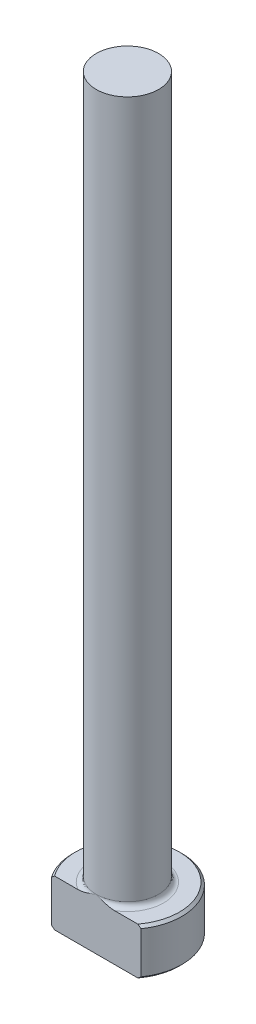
ISO-10303-21;
HEADER;
FILE_DESCRIPTION(('STEP AP214'),'2;1');
FILE_NAME('part.step','',(''),(''),'','','');
FILE_SCHEMA(('AUTOMOTIVE_DESIGN { 1 0 10303 214 1 1 1 1 }'));
ENDSEC;
DATA;
#1=APPLICATION_CONTEXT('core data for automotive mechanical design processes');
#2=APPLICATION_PROTOCOL_DEFINITION('international standard','automotive_design',2000,#1);
#3=PRODUCT_CONTEXT('',#1,'mechanical');
#4=PRODUCT('Part','Part','',(#3));
#5=PRODUCT_RELATED_PRODUCT_CATEGORY('part','',(#4));
#6=PRODUCT_DEFINITION_FORMATION('','',#4);
#7=PRODUCT_DEFINITION_CONTEXT('part definition',#1,'design');
#8=PRODUCT_DEFINITION('design','',#6,#7);
#9=PRODUCT_DEFINITION_SHAPE('','',#8);
#10=(LENGTH_UNIT() NAMED_UNIT(*) SI_UNIT(.MILLI.,.METRE.));
#11=(NAMED_UNIT(*) PLANE_ANGLE_UNIT() SI_UNIT($,.RADIAN.));
#12=(NAMED_UNIT(*) SI_UNIT($,.STERADIAN.) SOLID_ANGLE_UNIT());
#13=UNCERTAINTY_MEASURE_WITH_UNIT(LENGTH_MEASURE(1.E-05),#10,'distance_accuracy_value','');
#14=(GEOMETRIC_REPRESENTATION_CONTEXT(3) GLOBAL_UNCERTAINTY_ASSIGNED_CONTEXT((#13)) GLOBAL_UNIT_ASSIGNED_CONTEXT((#10,
#11,#12)) REPRESENTATION_CONTEXT('',''));
#15=CARTESIAN_POINT('',(0.,0.,0.));
#16=DIRECTION('',(0.,0.,1.));
#17=DIRECTION('',(1.,0.,0.));
#18=AXIS2_PLACEMENT_3D('',#15,#16,#17);
#19=CARTESIAN_POINT('',(0.,0.,0.));
#20=DIRECTION('',(0.,-1.,0.));
#21=DIRECTION('',(0.,0.,-1.));
#22=AXIS2_PLACEMENT_3D('',#19,#20,#21);
#23=PLANE('',#22);
#24=CARTESIAN_POINT('',(0.,0.,0.));
#25=DIRECTION('',(0.,-1.,0.));
#26=DIRECTION('',(0.,0.,-1.));
#27=AXIS2_PLACEMENT_3D('',#24,#25,#26);
#28=CIRCLE('',#27,5.29589999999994);
#29=CARTESIAN_POINT('',(-4.2386238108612,0.,3.17499999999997));
#30=VERTEX_POINT('',#29);
#31=CARTESIAN_POINT('',(4.2386238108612,0.,3.17499999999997));
#32=VERTEX_POINT('',#31);
#33=EDGE_CURVE('E98',#30,#32,#28,.T.);
#34=ORIENTED_EDGE('',*,*,#33,.T.);
#35=DIRECTION('',(-1.,0.,0.));
#36=VECTOR('',#35,1.);
#37=CARTESIAN_POINT('',(-4.55200670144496,0.,3.17499999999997));
#38=LINE('',#37,#36);
#39=EDGE_CURVE('E83',#32,#30,#38,.T.);
#40=ORIENTED_EDGE('',*,*,#39,.T.);
#41=EDGE_LOOP('',(#34,#40));
#42=FACE_BOUND('',#41,.T.);
#43=ADVANCED_FACE('F32',(#42),#23,.T.);
#44=CARTESIAN_POINT('',(0.,259.958771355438,0.));
#45=DIRECTION('',(0.,1.,0.));
#46=DIRECTION('',(0.,0.,1.));
#47=AXIS2_PLACEMENT_3D('',#44,#45,#46);
#48=CYLINDRICAL_SURFACE('',#47,5.54989999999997);
#49=CARTESIAN_POINT('',(0.,4.49580000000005,0.));
#50=DIRECTION('',(0.,1.,0.));
#51=DIRECTION('',(0.,0.,1.));
#52=AXIS2_PLACEMENT_3D('',#49,#50,#51);
#53=CIRCLE('',#52,5.54989999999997);
#54=CARTESIAN_POINT('',(-4.55200670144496,4.49580000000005,3.17499999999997));
#55=VERTEX_POINT('',#54);
#56=CARTESIAN_POINT('',(4.55200670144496,4.49580000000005,3.17499999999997));
#57=VERTEX_POINT('',#56);
#58=EDGE_CURVE('E104',#55,#57,#53,.F.);
#59=ORIENTED_EDGE('',*,*,#58,.T.);
#60=DIRECTION('',(0.,-1.,0.));
#61=VECTOR('',#60,1.);
#62=CARTESIAN_POINT('',(4.55200670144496,76.2,3.17499999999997));
#63=LINE('',#62,#61);
#64=CARTESIAN_POINT('',(4.55200670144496,0.254000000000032,3.17499999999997));
#65=VERTEX_POINT('',#64);
#66=EDGE_CURVE('E183',#57,#65,#63,.T.);
#67=ORIENTED_EDGE('',*,*,#66,.T.);
#68=CARTESIAN_POINT('',(0.,0.254000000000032,0.));
#69=DIRECTION('',(0.,-1.,0.));
#70=DIRECTION('',(0.,0.,-1.));
#71=AXIS2_PLACEMENT_3D('',#68,#69,#70);
#72=CIRCLE('',#71,5.54989999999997);
#73=CARTESIAN_POINT('',(-4.55200670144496,0.254000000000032,3.17499999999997));
#74=VERTEX_POINT('',#73);
#75=EDGE_CURVE('E100',#65,#74,#72,.F.);
#76=ORIENTED_EDGE('',*,*,#75,.T.);
#77=DIRECTION('',(0.,-1.,0.));
#78=VECTOR('',#77,1.);
#79=CARTESIAN_POINT('',(-4.55200670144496,76.2,3.17499999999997));
#80=LINE('',#79,#78);
#81=EDGE_CURVE('E93',#55,#74,#80,.T.);
#82=ORIENTED_EDGE('',*,*,#81,.F.);
#83=EDGE_LOOP('',(#59,#67,#76,#82));
#84=FACE_BOUND('',#83,.T.);
#85=ADVANCED_FACE('F158',(#84),#48,.T.);
#86=CARTESIAN_POINT('',(-5.54989999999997,4.7498,0.));
#87=DIRECTION('',(0.,1.,0.));
#88=DIRECTION('',(0.,0.,1.));
#89=AXIS2_PLACEMENT_3D('',#86,#87,#88);
#90=PLANE('',#89);
#91=CARTESIAN_POINT('',(0.,4.7498,0.));
#92=DIRECTION('',(0.,1.,0.));
#93=DIRECTION('',(0.,0.,1.));
#94=AXIS2_PLACEMENT_3D('',#91,#92,#93);
#95=CIRCLE('',#94,5.29590000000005);
#96=CARTESIAN_POINT('',(4.23862381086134,4.7498,3.17499999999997));
#97=VERTEX_POINT('',#96);
#98=CARTESIAN_POINT('',(-4.23862381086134,4.7498,3.17499999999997));
#99=VERTEX_POINT('',#98);
#100=EDGE_CURVE('E178',#97,#99,#95,.T.);
#101=ORIENTED_EDGE('',*,*,#100,.T.);
#102=DIRECTION('',(1.,0.,0.));
#103=VECTOR('',#102,1.);
#104=CARTESIAN_POINT('',(-5.54989999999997,4.7498,3.17499999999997));
#105=LINE('',#104,#103);
#106=CARTESIAN_POINT('',(-1.86651118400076,4.74979999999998,3.17499999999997));
#107=VERTEX_POINT('',#106);
#108=EDGE_CURVE('E57',#99,#107,#105,.T.);
#109=ORIENTED_EDGE('',*,*,#108,.T.);
#110=CARTESIAN_POINT('',(0.,4.7498,0.));
#111=DIRECTION('',(0.,1.,0.));
#112=DIRECTION('',(0.,0.,1.));
#113=AXIS2_PLACEMENT_3D('',#110,#111,#112);
#114=CIRCLE('',#113,3.68299999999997);
#115=CARTESIAN_POINT('',(1.86651118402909,4.74979999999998,3.17499999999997));
#116=VERTEX_POINT('',#115);
#117=EDGE_CURVE('E107',#107,#116,#114,.F.);
#118=ORIENTED_EDGE('',*,*,#117,.T.);
#119=EDGE_CURVE('E136',#116,#97,#105,.T.);
#120=ORIENTED_EDGE('',*,*,#119,.T.);
#121=EDGE_LOOP('',(#101,#109,#118,#120));
#122=FACE_BOUND('',#121,.T.);
#123=ADVANCED_FACE('F147',(#122),#90,.T.);
#124=CARTESIAN_POINT('',(0.,4.74980000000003,0.));
#125=DIRECTION('',(0.,-1.,0.));
#126=DIRECTION('',(0.,0.,-1.));
#127=AXIS2_PLACEMENT_3D('',#124,#125,#126);
#128=CONICAL_SURFACE('',#127,5.29590000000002,0.785398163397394);
#129=ORIENTED_EDGE('',*,*,#58,.F.);
#130=CARTESIAN_POINT('',(-10.0167402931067,-0.462188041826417,3.17499999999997));
#131=CARTESIAN_POINT('',(-9.83956615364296,-0.29329908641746,3.17499999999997));
#132=CARTESIAN_POINT('',(-9.66219175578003,-0.124620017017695,3.17499999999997));
#133=CARTESIAN_POINT('',(-9.3069644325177,0.212235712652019,3.17499999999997));
#134=CARTESIAN_POINT('',(-9.12911150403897,0.380412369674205,3.17499999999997));
#135=CARTESIAN_POINT('',(-8.59460771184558,0.88416858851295,3.17499999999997));
#136=CARTESIAN_POINT('',(-8.23712475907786,1.21886656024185,3.17499999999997));
#137=CARTESIAN_POINT('',(-7.51548848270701,1.88820774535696,3.17499999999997));
#138=CARTESIAN_POINT('',(-7.15130415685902,2.22281765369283,3.17499999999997));
#139=CARTESIAN_POINT('',(-6.60150494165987,2.72077471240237,3.17499999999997));
#140=CARTESIAN_POINT('',(-6.41766956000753,2.88608479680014,3.17499999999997));
#141=CARTESIAN_POINT('',(-6.04850874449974,3.21502923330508,3.17499999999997));
#142=CARTESIAN_POINT('',(-5.86318332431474,3.37866360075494,3.17499999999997));
#143=CARTESIAN_POINT('',(-5.42475636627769,3.76132794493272,3.17499999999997));
#144=CARTESIAN_POINT('',(-5.17087613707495,3.97947167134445,3.17499999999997));
#145=CARTESIAN_POINT('',(-4.78637219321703,4.30242579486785,3.17499999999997));
#146=CARTESIAN_POINT('',(-4.65755933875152,4.40939174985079,3.17499999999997));
#147=CARTESIAN_POINT('',(-4.39846835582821,4.6215318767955,3.17499999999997));
#148=CARTESIAN_POINT('',(-4.26819026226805,4.72670609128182,3.17499999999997));
#149=CARTESIAN_POINT('',(-4.00614386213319,4.93458819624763,3.17499999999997));
#150=CARTESIAN_POINT('',(-3.87437946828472,5.0373010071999,3.17499999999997));
#151=CARTESIAN_POINT('',(-3.60868880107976,5.23988426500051,3.17499999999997));
#152=CARTESIAN_POINT('',(-3.47476266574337,5.33975489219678,3.17499999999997));
#153=CARTESIAN_POINT('',(-3.20432566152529,5.53575009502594,3.17499999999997));
#154=CARTESIAN_POINT('',(-3.06781662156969,5.63187718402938,3.17499999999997));
#155=CARTESIAN_POINT('',(-2.79150743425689,5.81925786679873,3.17499999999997));
#156=CARTESIAN_POINT('',(-2.65170798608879,5.91051248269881,3.17499999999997));
#157=CARTESIAN_POINT('',(-2.40080357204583,6.06610461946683,3.17499999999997));
#158=CARTESIAN_POINT('',(-2.29053645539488,6.13178781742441,3.17499999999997));
#159=CARTESIAN_POINT('',(-2.06714717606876,6.25818980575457,3.17499999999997));
#160=CARTESIAN_POINT('',(-1.95402458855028,6.31890785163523,3.17499999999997));
#161=CARTESIAN_POINT('',(-1.72463633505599,6.43389240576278,3.17499999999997));
#162=CARTESIAN_POINT('',(-1.60837338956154,6.48816429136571,3.17499999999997));
#163=CARTESIAN_POINT('',(-1.37232485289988,6.58846115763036,3.17499999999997));
#164=CARTESIAN_POINT('',(-1.25254039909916,6.63448876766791,3.17499999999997));
#165=CARTESIAN_POINT('',(-1.03847127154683,6.70631999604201,3.17499999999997));
#166=CARTESIAN_POINT('',(-0.944930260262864,6.73432823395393,3.17499999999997));
#167=CARTESIAN_POINT('',(-0.75601186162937,6.78320653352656,3.17499999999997));
#168=CARTESIAN_POINT('',(-0.660635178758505,6.80407927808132,3.17499999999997));
#169=CARTESIAN_POINT('',(-0.46875225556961,6.83766834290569,3.17499999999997));
#170=CARTESIAN_POINT('',(-0.372250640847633,6.85041070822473,3.17499999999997));
#171=CARTESIAN_POINT('',(-0.178484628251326,6.86715141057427,3.17499999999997));
#172=CARTESIAN_POINT('',(-0.0812202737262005,6.87115024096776,3.17499999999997));
#173=CARTESIAN_POINT('',(0.113557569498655,6.87016742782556,3.17499999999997));
#174=CARTESIAN_POINT('',(0.211070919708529,6.86515852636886,3.17499999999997));
#175=CARTESIAN_POINT('',(0.405245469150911,6.84640245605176,3.17499999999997));
#176=CARTESIAN_POINT('',(0.501906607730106,6.83265467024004,3.17499999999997));
#177=CARTESIAN_POINT('',(0.694033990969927,6.79710670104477,3.17499999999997));
#178=CARTESIAN_POINT('',(0.789495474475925,6.77528112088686,3.17499999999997));
#179=CARTESIAN_POINT('',(0.978501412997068,6.72458544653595,3.17499999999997));
#180=CARTESIAN_POINT('',(1.07204574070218,6.69571488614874,3.17499999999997));
#181=CARTESIAN_POINT('',(1.36820011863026,6.59374975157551,3.17499999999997));
#182=CARTESIAN_POINT('',(1.56688529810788,6.50918166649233,3.17499999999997));
#183=CARTESIAN_POINT('',(1.85781194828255,6.36807703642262,3.17499999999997));
#184=CARTESIAN_POINT('',(1.95370879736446,6.3186024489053,3.17499999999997));
#185=CARTESIAN_POINT('',(2.14339771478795,6.21576230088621,3.17499999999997));
#186=CARTESIAN_POINT('',(2.23719011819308,6.16239736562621,3.17499999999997));
#187=CARTESIAN_POINT('',(2.42421725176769,6.05174311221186,3.17499999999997));
#188=CARTESIAN_POINT('',(2.5174250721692,5.99440876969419,3.17499999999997));
#189=CARTESIAN_POINT('',(2.7021637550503,5.87710026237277,3.17499999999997));
#190=CARTESIAN_POINT('',(2.79369457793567,5.81712603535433,3.17499999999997));
#191=CARTESIAN_POINT('',(2.97520639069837,5.69507129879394,3.17499999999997));
#192=CARTESIAN_POINT('',(3.06518880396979,5.63299289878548,3.17499999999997));
#193=CARTESIAN_POINT('',(3.24388392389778,5.50704415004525,3.17499999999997));
#194=CARTESIAN_POINT('',(3.33259666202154,5.44317384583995,3.17499999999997));
#195=CARTESIAN_POINT('',(3.57597346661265,5.26479758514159,3.17499999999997));
#196=CARTESIAN_POINT('',(3.72948709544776,5.14872224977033,3.17499999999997));
#197=CARTESIAN_POINT('',(4.03385257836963,4.91312427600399,3.17499999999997));
#198=CARTESIAN_POINT('',(4.18470417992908,4.79360131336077,3.17499999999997));
#199=CARTESIAN_POINT('',(4.48432539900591,4.5518890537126,3.17499999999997));
#200=CARTESIAN_POINT('',(4.63309438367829,4.42969897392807,3.17499999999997));
#201=CARTESIAN_POINT('',(4.92891951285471,4.18325994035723,3.17499999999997));
#202=CARTESIAN_POINT('',(5.07597561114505,4.05901093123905,3.17499999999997));
#203=CARTESIAN_POINT('',(5.51556942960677,3.68340723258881,3.17499999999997));
#204=CARTESIAN_POINT('',(5.80602157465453,3.42961335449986,3.17499999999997));
#205=CARTESIAN_POINT('',(6.38307996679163,2.91781719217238,3.17499999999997));
#206=CARTESIAN_POINT('',(6.66968688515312,2.65981566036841,3.17499999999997));
#207=CARTESIAN_POINT('',(7.21375125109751,2.16488107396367,3.17499999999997));
#208=CARTESIAN_POINT('',(7.47144859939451,1.92821133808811,3.17499999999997));
#209=CARTESIAN_POINT('',(7.98516371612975,1.45303114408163,3.17499999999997));
#210=CARTESIAN_POINT('',(8.24118139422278,1.21452058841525,3.17499999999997));
#211=CARTESIAN_POINT('',(8.75104638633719,0.736915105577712,3.17499999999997));
#212=CARTESIAN_POINT('',(9.00489811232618,0.497824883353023,3.17499999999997));
#213=CARTESIAN_POINT('',(9.51154344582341,0.0185627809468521,3.17499999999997));
#214=CARTESIAN_POINT('',(9.76433712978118,-0.221609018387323,3.17499999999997));
#215=CARTESIAN_POINT('',(10.0167402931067,-0.462188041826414,3.17499999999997));
#216=B_SPLINE_CURVE_WITH_KNOTS('',3,(#130,#131,#132,#133,#134,#135,#136,#137,#138,#139,#140,
#141,#142,#143,#144,#145,#146,#147,#148,#149,#150,#151,#152,#153,#154,#155,#156,#157,#158,#159,
#160,#161,#162,#163,#164,#165,#166,#167,#168,#169,#170,#171,#172,#173,#174,#175,#176,#177,#178,
#179,#180,#181,#182,#183,#184,#185,#186,#187,#188,#189,#190,#191,#192,#193,#194,#195,#196,#197,
#198,#199,#200,#201,#202,#203,#204,#205,#206,#207,#208,#209,#210,#211,#212,#213,#214,#215),
.UNSPECIFIED.,.F.,.F.,(4,2,2,2,2,2,2,2,2,2,2,2,2,2,2,2,2,2,2,2,2,2,2,2,2,2,2,2,2,2,2,2,2,2,2,2,
2,2,2,2,2,2,4),(0.,0.734320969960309,1.46864667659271,2.93776649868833,4.4214216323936,
5.16310419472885,5.90477996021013,6.90888979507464,7.41118265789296,7.9134635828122,
8.41463858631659,8.9157817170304,9.41658237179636,9.9172775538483,10.3022224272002,
10.68722491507,11.0719039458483,11.4564600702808,11.7491569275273,12.0417436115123,
12.3333882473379,12.6250164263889,12.9175285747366,13.2100613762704,13.5035218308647,
13.7970017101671,14.4429112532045,14.7666018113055,15.0902404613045,15.4184826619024,
15.7467326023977,16.0746626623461,16.4025845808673,16.9798839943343,17.5572378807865,
18.1347635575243,18.7123047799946,19.8693665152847,21.0262235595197,22.0758708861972,
23.1255742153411,24.1717271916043,25.2178032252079),.UNSPECIFIED.);
#217=EDGE_CURVE('E135',#55,#99,#216,.T.);
#218=ORIENTED_EDGE('',*,*,#217,.T.);
#219=ORIENTED_EDGE('',*,*,#100,.F.);
#220=EDGE_CURVE('E127',#97,#57,#216,.T.);
#221=ORIENTED_EDGE('',*,*,#220,.T.);
#222=EDGE_LOOP('',(#129,#218,#219,#221));
#223=FACE_BOUND('',#222,.T.);
#224=ADVANCED_FACE('F143',(#223),#128,.T.);
#225=CARTESIAN_POINT('',(0.,0.254000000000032,0.));
#226=DIRECTION('',(0.,1.,0.));
#227=DIRECTION('',(0.,0.,1.));
#228=AXIS2_PLACEMENT_3D('',#225,#226,#227);
#229=CONICAL_SURFACE('',#228,5.54989999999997,0.785398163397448);
#230=ORIENTED_EDGE('',*,*,#75,.F.);
#231=CARTESIAN_POINT('',(10.0167402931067,5.21198804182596,3.17499999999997));
#232=CARTESIAN_POINT('',(9.83956615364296,5.04309908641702,3.17499999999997));
#233=CARTESIAN_POINT('',(9.66219175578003,4.87442001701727,3.17499999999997));
#234=CARTESIAN_POINT('',(9.3069644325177,4.53756428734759,3.17499999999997));
#235=CARTESIAN_POINT('',(9.12911150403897,4.36938763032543,3.17499999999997));
#236=CARTESIAN_POINT('',(8.59460771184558,3.86563141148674,3.17499999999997));
#237=CARTESIAN_POINT('',(8.23712475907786,3.53093343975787,3.17499999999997));
#238=CARTESIAN_POINT('',(7.51548848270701,2.86159225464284,3.17499999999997));
#239=CARTESIAN_POINT('',(7.15130415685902,2.52698234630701,3.17499999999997));
#240=CARTESIAN_POINT('',(6.60150494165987,2.02902528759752,3.17499999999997));
#241=CARTESIAN_POINT('',(6.41766956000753,1.86371520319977,3.17499999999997));
#242=CARTESIAN_POINT('',(6.04850874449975,1.53477076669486,3.17499999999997));
#243=CARTESIAN_POINT('',(5.86318332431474,1.37113639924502,3.17499999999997));
#244=CARTESIAN_POINT('',(5.42475636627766,0.988472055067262,3.17499999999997));
#245=CARTESIAN_POINT('',(5.1708761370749,0.770328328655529,3.17499999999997));
#246=CARTESIAN_POINT('',(4.78637219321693,0.447374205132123,3.17499999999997));
#247=CARTESIAN_POINT('',(4.65755933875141,0.340408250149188,3.17499999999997));
#248=CARTESIAN_POINT('',(4.39846835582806,0.128268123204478,3.17499999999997));
#249=CARTESIAN_POINT('',(4.26819026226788,0.0230939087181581,3.17499999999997));
#250=CARTESIAN_POINT('',(4.00614386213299,-0.18478819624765,3.17499999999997));
#251=CARTESIAN_POINT('',(3.87437946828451,-0.287501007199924,3.17499999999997));
#252=CARTESIAN_POINT('',(3.60868880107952,-0.490084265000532,3.17499999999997));
#253=CARTESIAN_POINT('',(3.4747626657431,-0.589954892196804,3.17499999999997));
#254=CARTESIAN_POINT('',(3.20432566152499,-0.78595009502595,3.17499999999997));
#255=CARTESIAN_POINT('',(3.06781662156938,-0.882077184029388,3.17499999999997));
#256=CARTESIAN_POINT('',(2.79150743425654,-1.06945786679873,3.17499999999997));
#257=CARTESIAN_POINT('',(2.65170798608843,-1.16071248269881,3.17499999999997));
#258=CARTESIAN_POINT('',(2.40080357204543,-1.31630461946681,3.17499999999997));
#259=CARTESIAN_POINT('',(2.29053645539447,-1.38198781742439,3.17499999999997));
#260=CARTESIAN_POINT('',(2.06714717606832,-1.50838980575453,3.17499999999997));
#261=CARTESIAN_POINT('',(1.95402458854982,-1.56910785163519,3.17499999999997));
#262=CARTESIAN_POINT('',(1.7246363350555,-1.68409240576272,3.17499999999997));
#263=CARTESIAN_POINT('',(1.60837338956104,-1.73836429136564,3.17499999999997));
#264=CARTESIAN_POINT('',(1.37232485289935,-1.83866115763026,3.17499999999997));
#265=CARTESIAN_POINT('',(1.25254039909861,-1.8846887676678,3.17499999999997));
#266=CARTESIAN_POINT('',(1.03847127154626,-1.95651999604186,3.17499999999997));
#267=CARTESIAN_POINT('',(0.944930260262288,-1.98452823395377,3.17499999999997));
#268=CARTESIAN_POINT('',(0.756011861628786,-2.03340653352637,3.17499999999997));
#269=CARTESIAN_POINT('',(0.660635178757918,-2.05427927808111,3.17499999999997));
#270=CARTESIAN_POINT('',(0.468752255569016,-2.08786834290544,3.17499999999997));
#271=CARTESIAN_POINT('',(0.372250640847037,-2.10061070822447,3.17499999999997));
#272=CARTESIAN_POINT('',(0.178484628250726,-2.11735141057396,3.17499999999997));
#273=CARTESIAN_POINT('',(0.0812202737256,-2.12135024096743,3.17499999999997));
#274=CARTESIAN_POINT('',(-0.113557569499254,-2.1203674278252,3.17499999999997));
#275=CARTESIAN_POINT('',(-0.211070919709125,-2.11535852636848,3.17499999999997));
#276=CARTESIAN_POINT('',(-0.405245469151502,-2.09660245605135,3.17499999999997));
#277=CARTESIAN_POINT('',(-0.501906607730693,-2.08285467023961,3.17499999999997));
#278=CARTESIAN_POINT('',(-0.694033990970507,-2.04730670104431,3.17499999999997));
#279=CARTESIAN_POINT('',(-0.789495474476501,-2.02548112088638,3.17499999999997));
#280=CARTESIAN_POINT('',(-0.978501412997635,-1.97478544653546,3.17499999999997));
#281=CARTESIAN_POINT('',(-1.07204574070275,-1.94591488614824,3.17499999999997));
#282=CARTESIAN_POINT('',(-1.36820011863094,-1.84394975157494,3.17499999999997));
#283=CARTESIAN_POINT('',(-1.56688529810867,-1.75938166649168,3.17499999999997));
#284=CARTESIAN_POINT('',(-1.85781194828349,-1.61827703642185,3.17499999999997));
#285=CARTESIAN_POINT('',(-1.95370879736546,-1.56880244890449,3.17499999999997));
#286=CARTESIAN_POINT('',(-2.14339771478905,-1.46596230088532,3.17499999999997));
#287=CARTESIAN_POINT('',(-2.23719011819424,-1.41259736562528,3.17499999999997));
#288=CARTESIAN_POINT('',(-2.42421725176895,-1.30194311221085,3.17499999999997));
#289=CARTESIAN_POINT('',(-2.51742507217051,-1.24460876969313,3.17499999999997));
#290=CARTESIAN_POINT('',(-2.70216375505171,-1.12730026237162,3.17499999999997));
#291=CARTESIAN_POINT('',(-2.79369457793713,-1.06732603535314,3.17499999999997));
#292=CARTESIAN_POINT('',(-2.97520639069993,-0.94527129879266,3.17499999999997));
#293=CARTESIAN_POINT('',(-3.0651888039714,-0.883192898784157,3.17499999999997));
#294=CARTESIAN_POINT('',(-3.24388392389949,-0.757244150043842,3.17499999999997));
#295=CARTESIAN_POINT('',(-3.33259666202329,-0.693373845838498,3.17499999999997));
#296=CARTESIAN_POINT('',(-3.57597346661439,-0.514997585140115,3.17499999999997));
#297=CARTESIAN_POINT('',(-3.72948709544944,-0.398922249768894,3.17499999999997));
#298=CARTESIAN_POINT('',(-4.0338525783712,-0.163324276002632,3.17499999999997));
#299=CARTESIAN_POINT('',(-4.18470417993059,-0.0438013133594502,3.17499999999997));
#300=CARTESIAN_POINT('',(-4.48432539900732,0.197910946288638,3.17499999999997));
#301=CARTESIAN_POINT('',(-4.63309438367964,0.320101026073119,3.17499999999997));
#302=CARTESIAN_POINT('',(-4.92891951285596,0.566540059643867,3.17499999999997));
#303=CARTESIAN_POINT('',(-5.07597561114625,0.690789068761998,3.17499999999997));
#304=CARTESIAN_POINT('',(-5.51556942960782,1.0663927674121,3.17499999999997));
#305=CARTESIAN_POINT('',(-5.80602157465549,1.32018664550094,3.17499999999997));
#306=CARTESIAN_POINT('',(-6.38307996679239,1.83198280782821,3.17499999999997));
#307=CARTESIAN_POINT('',(-6.66968688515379,2.08998433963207,3.17499999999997));
#308=CARTESIAN_POINT('',(-7.21375125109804,2.58491892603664,3.17499999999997));
#309=CARTESIAN_POINT('',(-7.47144859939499,2.82158866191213,3.17499999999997));
#310=CARTESIAN_POINT('',(-7.98516371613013,3.29676885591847,3.17499999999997));
#311=CARTESIAN_POINT('',(-8.2411813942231,3.53527941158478,3.17499999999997));
#312=CARTESIAN_POINT('',(-8.75104638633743,4.01288489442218,3.17499999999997));
#313=CARTESIAN_POINT('',(-9.00489811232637,4.2519751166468,3.17499999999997));
#314=CARTESIAN_POINT('',(-9.5115434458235,4.73123721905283,3.17499999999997));
#315=CARTESIAN_POINT('',(-9.76433712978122,4.97140901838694,3.17499999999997));
#316=CARTESIAN_POINT('',(-10.0167402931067,5.21198804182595,3.17499999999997));
#317=B_SPLINE_CURVE_WITH_KNOTS('',3,(#231,#232,#233,#234,#235,#236,#237,#238,#239,#240,#241,
#242,#243,#244,#245,#246,#247,#248,#249,#250,#251,#252,#253,#254,#255,#256,#257,#258,#259,#260,
#261,#262,#263,#264,#265,#266,#267,#268,#269,#270,#271,#272,#273,#274,#275,#276,#277,#278,#279,
#280,#281,#282,#283,#284,#285,#286,#287,#288,#289,#290,#291,#292,#293,#294,#295,#296,#297,#298,
#299,#300,#301,#302,#303,#304,#305,#306,#307,#308,#309,#310,#311,#312,#313,#314,#315,#316),
.UNSPECIFIED.,.F.,.F.,(4,2,2,2,2,2,2,2,2,2,2,2,2,2,2,2,2,2,2,2,2,2,2,2,2,2,2,2,2,2,2,2,2,2,2,2,
2,2,2,2,2,2,4),(0.,0.734320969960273,1.46864667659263,2.93776649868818,4.42142163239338,
5.16310419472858,5.90477996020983,6.90888979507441,7.41118265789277,7.91346358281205,
8.41463858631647,8.91578171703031,9.41658237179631,9.91727755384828,10.3022224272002,
10.68722491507,11.0719039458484,11.4564600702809,11.7491569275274,12.0417436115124,
12.333388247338,12.625016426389,12.9175285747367,13.2100613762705,13.5035218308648,
13.7970017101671,14.442911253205,14.7666018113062,15.0902404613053,15.4184826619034,
15.7467326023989,16.0746626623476,16.402584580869,16.9798839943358,17.5572378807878,
18.1347635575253,18.7123047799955,19.8693665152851,21.0262235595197,22.075870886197,
23.1255742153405,24.1717271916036,25.2178032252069),.UNSPECIFIED.);
#318=EDGE_CURVE('E86',#65,#32,#317,.T.);
#319=ORIENTED_EDGE('',*,*,#318,.T.);
#320=ORIENTED_EDGE('',*,*,#33,.F.);
#321=EDGE_CURVE('E89',#30,#74,#317,.T.);
#322=ORIENTED_EDGE('',*,*,#321,.T.);
#323=EDGE_LOOP('',(#230,#319,#320,#322));
#324=FACE_BOUND('',#323,.T.);
#325=ADVANCED_FACE('F97',(#324),#229,.T.);
#326=CARTESIAN_POINT('',(0.,5.25779999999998,0.));
#327=DIRECTION('',(0.,1.,0.));
#328=DIRECTION('',(0.,0.,1.));
#329=AXIS2_PLACEMENT_3D('',#326,#327,#328);
#330=TOROIDAL_SURFACE('',#329,3.68299999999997,0.508);
#331=CARTESIAN_POINT('',(0.,5.25779999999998,3.17499999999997));
#332=CARTESIAN_POINT('',(1.80769053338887E-10,5.25780081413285,3.17499999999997));
#333=CARTESIAN_POINT('',(1.73023885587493E-07,5.25780162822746,3.17499999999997));
#334=CARTESIAN_POINT('',(7.19628533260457E-07,5.25780319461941,3.17499999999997));
#335=CARTESIAN_POINT('',(1.09883574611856E-06,5.25780394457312,3.17499999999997));
#336=CARTESIAN_POINT('',(2.00966877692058E-06,5.25780544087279,3.17499999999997));
#337=CARTESIAN_POINT('',(2.55212990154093E-06,5.25780618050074,3.17499999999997));
#338=CARTESIAN_POINT('',(3.72136332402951E-06,5.25780757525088,3.17499999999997));
#339=CARTESIAN_POINT('',(4.34736599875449E-06,5.25780823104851,3.17499999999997));
#340=CARTESIAN_POINT('',(6.59438229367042E-06,5.25781043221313,3.17499999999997));
#341=CARTESIAN_POINT('',(8.32481538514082E-06,5.25781186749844,3.17499999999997));
#342=CARTESIAN_POINT('',(1.18988287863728E-05,5.25781442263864,3.17499999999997));
#343=CARTESIAN_POINT('',(1.37358815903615E-05,5.25781555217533,3.17499999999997));
#344=CARTESIAN_POINT('',(2.09135300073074E-05,5.25781980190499,3.17499999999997));
#345=CARTESIAN_POINT('',(2.63912469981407E-05,5.25782270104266,3.17499999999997));
#346=CARTESIAN_POINT('',(3.71867761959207E-05,5.25782743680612,3.17499999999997));
#347=CARTESIAN_POINT('',(4.24736618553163E-05,5.25782934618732,3.17499999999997));
#348=CARTESIAN_POINT('',(6.50188365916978E-05,5.25783746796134,3.17499999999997));
#349=CARTESIAN_POINT('',(8.22815781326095E-05,5.25784363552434,3.17499999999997));
#350=CARTESIAN_POINT('',(0.000114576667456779,5.25785352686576,3.17499999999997));
#351=CARTESIAN_POINT('',(0.000129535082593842,5.25785748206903,3.17499999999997));
#352=CARTESIAN_POINT('',(0.000238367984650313,5.25788883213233,3.17499999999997));
#353=CARTESIAN_POINT('',(0.000328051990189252,5.25792882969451,3.17499999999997));
#354=CARTESIAN_POINT('',(0.000676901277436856,5.25807871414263,3.17499999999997));
#355=CARTESIAN_POINT('',(0.000938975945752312,5.25817923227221,3.17499999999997));
#356=CARTESIAN_POINT('',(0.001957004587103,5.25857549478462,3.17499999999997));
#357=CARTESIAN_POINT('',(0.00270997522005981,5.25888105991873,3.17499999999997));
#358=CARTESIAN_POINT('',(0.00579427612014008,5.26012678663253,3.17499999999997));
#359=CARTESIAN_POINT('',(0.00812889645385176,5.26105588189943,3.17499999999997));
#360=CARTESIAN_POINT('',(0.0536737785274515,5.27918868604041,3.17499999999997));
#361=CARTESIAN_POINT('',(0.0968493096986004,5.29651116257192,3.17499999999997));
#362=CARTESIAN_POINT('',(0.181675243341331,5.33030366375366,3.17499999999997));
#363=CARTESIAN_POINT('',(0.22332279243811,5.34678146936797,3.17499999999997));
#364=CARTESIAN_POINT('',(0.311600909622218,5.38141206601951,3.17499999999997));
#365=CARTESIAN_POINT('',(0.358243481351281,5.39953485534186,3.17499999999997));
#366=CARTESIAN_POINT('',(0.452199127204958,5.43546002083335,3.17499999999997));
#367=CARTESIAN_POINT('',(0.499514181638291,5.4532572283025,3.17499999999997));
#368=CARTESIAN_POINT('',(0.581915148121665,5.48356219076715,3.17499999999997));
#369=CARTESIAN_POINT('',(0.616942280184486,5.49622931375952,3.17499999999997));
#370=CARTESIAN_POINT('',(0.687074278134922,5.52107238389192,3.17499999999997));
#371=CARTESIAN_POINT('',(0.722178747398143,5.53324945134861,3.17499999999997));
#372=CARTESIAN_POINT('',(0.82617821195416,5.56842938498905,3.17499999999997));
#373=CARTESIAN_POINT('',(0.895335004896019,5.59066808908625,3.17499999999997));
#374=CARTESIAN_POINT('',(1.04440355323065,5.63534989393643,3.17499999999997));
#375=CARTESIAN_POINT('',(1.12444395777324,5.65737079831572,3.17499999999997));
#376=CARTESIAN_POINT('',(1.28636529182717,5.69671209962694,3.17499999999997));
#377=CARTESIAN_POINT('',(1.36825573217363,5.71399428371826,3.17499999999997));
#378=CARTESIAN_POINT('',(1.53827501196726,5.74289044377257,3.17499999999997));
#379=CARTESIAN_POINT('',(1.6264772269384,5.754089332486,3.17499999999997));
#380=CARTESIAN_POINT('',(1.80336979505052,5.766538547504,3.17499999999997));
#381=CARTESIAN_POINT('',(1.89205668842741,5.76782927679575,3.17499999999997));
#382=CARTESIAN_POINT('',(2.04614946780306,5.75829207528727,3.17499999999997));
#383=CARTESIAN_POINT('',(2.1117267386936,5.7504696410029,3.17499999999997));
#384=CARTESIAN_POINT('',(2.24032569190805,5.72527330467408,3.17499999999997));
#385=CARTESIAN_POINT('',(2.30336992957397,5.70802985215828,3.17499999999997));
#386=CARTESIAN_POINT('',(2.3964725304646,5.67213651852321,3.17499999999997));
#387=CARTESIAN_POINT('',(2.42822079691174,5.65788049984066,3.17499999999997));
#388=CARTESIAN_POINT('',(2.48965433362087,5.62525897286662,3.17499999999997));
#389=CARTESIAN_POINT('',(2.51933677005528,5.60688795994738,3.17499999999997));
#390=CARTESIAN_POINT('',(2.56994777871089,5.56951032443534,3.17499999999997));
#391=CARTESIAN_POINT('',(2.59146237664,5.55130442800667,3.17499999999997));
#392=CARTESIAN_POINT('',(2.63132394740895,5.5117021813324,3.17499999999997));
#393=CARTESIAN_POINT('',(2.64967743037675,5.49031256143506,3.17499999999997));
#394=CARTESIAN_POINT('',(2.67804602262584,5.4500327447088,3.17499999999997));
#395=CARTESIAN_POINT('',(2.6890027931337,5.43180880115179,3.17499999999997));
#396=CARTESIAN_POINT('',(2.7078017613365,5.3938065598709,3.17499999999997));
#397=CARTESIAN_POINT('',(2.71564587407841,5.37402922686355,3.17499999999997));
#398=CARTESIAN_POINT('',(2.72769754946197,5.33322214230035,3.17499999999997));
#399=CARTESIAN_POINT('',(2.73187843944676,5.31218437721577,3.17499999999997));
#400=CARTESIAN_POINT('',(2.73613267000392,5.26969745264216,3.17499999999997));
#401=CARTESIAN_POINT('',(2.73620805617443,5.24824850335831,3.17499999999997));
#402=CARTESIAN_POINT('',(2.73247730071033,5.20813635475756,3.17499999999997));
#403=CARTESIAN_POINT('',(2.72910595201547,5.18943073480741,3.17499999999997));
#404=CARTESIAN_POINT('',(2.71937153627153,5.15282145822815,3.17499999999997));
#405=CARTESIAN_POINT('',(2.71300800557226,5.13491792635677,3.17499999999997));
#406=CARTESIAN_POINT('',(2.69740230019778,5.0996670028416,3.17499999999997));
#407=CARTESIAN_POINT('',(2.68806645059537,5.08236154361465,3.17499999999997));
#408=CARTESIAN_POINT('',(2.66708571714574,5.04922644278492,3.17499999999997));
#409=CARTESIAN_POINT('',(2.65543987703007,5.03339741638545,3.17499999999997));
#410=CARTESIAN_POINT('',(2.62294588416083,4.99450310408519,3.17499999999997));
#411=CARTESIAN_POINT('',(2.60069446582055,4.9726078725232,3.17499999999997));
#412=CARTESIAN_POINT('',(2.55299669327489,4.93259922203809,3.17499999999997));
#413=CARTESIAN_POINT('',(2.52754047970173,4.91449795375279,3.17499999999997));
#414=CARTESIAN_POINT('',(2.46015073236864,4.87290115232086,3.17499999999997));
#415=CARTESIAN_POINT('',(2.41675555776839,4.85178783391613,3.17499999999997));
#416=CARTESIAN_POINT('',(2.32743780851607,4.81642640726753,3.17499999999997));
#417=CARTESIAN_POINT('',(2.28151740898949,4.80217249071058,3.17499999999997));
#418=CARTESIAN_POINT('',(2.19492730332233,4.78086425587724,3.17499999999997));
#419=CARTESIAN_POINT('',(2.15443153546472,4.77307762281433,3.17499999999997));
#420=CARTESIAN_POINT('',(2.07290577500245,4.7609987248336,3.17499999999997));
#421=CARTESIAN_POINT('',(2.03187536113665,4.75670940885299,3.17499999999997));
#422=CARTESIAN_POINT('',(1.90717655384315,4.74822293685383,3.17499999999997));
#423=CARTESIAN_POINT('',(1.82319261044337,4.74868666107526,3.17499999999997));
#424=CARTESIAN_POINT('',(1.62833175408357,4.76032593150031,3.17499999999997));
#425=CARTESIAN_POINT('',(1.51770881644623,4.77497959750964,3.17499999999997));
#426=CARTESIAN_POINT('',(1.29813873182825,4.81534590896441,3.17499999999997));
#427=CARTESIAN_POINT('',(1.18920134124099,4.84110792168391,3.17499999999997));
#428=CARTESIAN_POINT('',(0.982215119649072,4.89780610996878,3.17499999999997));
#429=CARTESIAN_POINT('',(0.883999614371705,4.92815337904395,3.17499999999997));
#430=CARTESIAN_POINT('',(0.689996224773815,4.99284004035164,3.17499999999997));
#431=CARTESIAN_POINT('',(0.594193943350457,5.02713703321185,3.17499999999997));
#432=CARTESIAN_POINT('',(0.464142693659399,5.07567249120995,3.17499999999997));
#433=CARTESIAN_POINT('',(0.429471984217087,5.08880513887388,3.17499999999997));
#434=CARTESIAN_POINT('',(0.359331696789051,5.11568278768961,3.17499999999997));
#435=CARTESIAN_POINT('',(0.323864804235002,5.12943483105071,3.17499999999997));
#436=CARTESIAN_POINT('',(0.263992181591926,5.15284621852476,3.17499999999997));
#437=CARTESIAN_POINT('',(0.239565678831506,5.16245280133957,3.17499999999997));
#438=CARTESIAN_POINT('',(0.190982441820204,5.18164529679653,3.17499999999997));
#439=CARTESIAN_POINT('',(0.166825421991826,5.19123047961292,3.17499999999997));
#440=CARTESIAN_POINT('',(0.121037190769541,5.20943918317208,3.17499999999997));
#441=CARTESIAN_POINT('',(0.0994044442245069,5.21805909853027,3.17499999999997));
#442=CARTESIAN_POINT('',(0.0553410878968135,5.2356763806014,3.17499999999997));
#443=CARTESIAN_POINT('',(0.0329111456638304,5.24467572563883,3.17499999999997));
#444=CARTESIAN_POINT('',(0.00813211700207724,5.25454302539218,3.17499999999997));
#445=CARTESIAN_POINT('',(0.00580062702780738,5.25547072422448,3.17499999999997));
#446=CARTESIAN_POINT('',(0.00271708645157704,5.25671609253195,3.17499999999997));
#447=CARTESIAN_POINT('',(0.00196172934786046,5.25702263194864,3.17499999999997));
#448=CARTESIAN_POINT('',(0.000940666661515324,5.25742007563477,3.17499999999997));
#449=CARTESIAN_POINT('',(0.000677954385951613,5.25752083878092,3.17499999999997));
#450=CARTESIAN_POINT('',(0.000328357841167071,5.25767104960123,3.17499999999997));
#451=CARTESIAN_POINT('',(0.000238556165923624,5.25771109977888,3.17499999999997));
#452=CARTESIAN_POINT('',(0.000129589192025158,5.25774247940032,3.17499999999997));
#453=CARTESIAN_POINT('',(0.000114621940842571,5.25774643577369,3.17499999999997));
#454=CARTESIAN_POINT('',(8.23074123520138E-05,5.25775633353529,3.17499999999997));
#455=CARTESIAN_POINT('',(6.50343069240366E-05,5.25776250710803,3.17499999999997));
#456=CARTESIAN_POINT('',(4.24775013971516E-05,5.25777063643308,3.17499999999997));
#457=CARTESIAN_POINT('',(3.71892385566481E-05,5.25777254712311,3.17499999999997));
#458=CARTESIAN_POINT('',(2.63911145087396E-05,5.25777728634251,3.17499999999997));
#459=CARTESIAN_POINT('',(2.09122302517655E-05,5.25778018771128,3.17499999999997));
#460=CARTESIAN_POINT('',(1.37334835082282E-05,5.25778444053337,3.17499999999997));
#461=CARTESIAN_POINT('',(1.189632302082E-05,5.25778557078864,3.17499999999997));
#462=CARTESIAN_POINT('',(8.32223670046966E-06,5.25778812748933,3.17499999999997));
#463=CARTESIAN_POINT('',(6.59184566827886E-06,5.25778956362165,3.17499999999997));
#464=CARTESIAN_POINT('',(4.34505756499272E-06,5.25779176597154,3.17499999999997));
#465=CARTESIAN_POINT('',(3.71915459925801E-06,5.25779242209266,3.17499999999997));
#466=CARTESIAN_POINT('',(2.55017854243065E-06,5.25779381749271,3.17499999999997));
#467=CARTESIAN_POINT('',(2.00787573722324E-06,5.25779455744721,3.17499999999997));
#468=CARTESIAN_POINT('',(1.09742559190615E-06,5.25779605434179,3.17499999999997));
#469=CARTESIAN_POINT('',(7.18435041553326E-07,5.25779680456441,3.17499999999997));
#470=CARTESIAN_POINT('',(1.72356606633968E-07,5.25779837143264,3.17499999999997));
#471=CARTESIAN_POINT('',(-1.80798290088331E-10,5.25779918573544,3.17499999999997));
#472=CARTESIAN_POINT('',(0.,5.25779999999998,3.17499999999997));
#473=B_SPLINE_CURVE_WITH_KNOTS('',3,(#331,#332,#333,#334,#335,#336,#337,#338,#339,#340,#341,
#342,#343,#344,#345,#346,#347,#348,#349,#350,#351,#352,#353,#354,#355,#356,#357,#358,#359,#360,
#361,#362,#363,#364,#365,#366,#367,#368,#369,#370,#371,#372,#373,#374,#375,#376,#377,#378,#379,
#380,#381,#382,#383,#384,#385,#386,#387,#388,#389,#390,#391,#392,#393,#394,#395,#396,#397,#398,
#399,#400,#401,#402,#403,#404,#405,#406,#407,#408,#409,#410,#411,#412,#413,#414,#415,#416,#417,
#418,#419,#420,#421,#422,#423,#424,#425,#426,#427,#428,#429,#430,#431,#432,#433,#434,#435,#436,
#437,#438,#439,#440,#441,#442,#443,#444,#445,#446,#447,#448,#449,#450,#451,#452,#453,#454,#455,
#456,#457,#458,#459,#460,#461,#462,#463,#464,#465,#466,#467,#468,#469,#470,#471,#472),
.UNSPECIFIED.,.T.,.F.,(4,2,2,2,2,2,2,2,2,2,2,2,2,2,2,2,2,2,2,2,2,2,2,2,2,2,2,2,2,2,2,2,2,2,2,2,
2,2,2,2,2,2,2,2,2,2,2,2,2,2,2,2,2,2,2,2,2,2,2,2,2,2,2,2,2,2,2,2,2,2,4),(0.,2.44115442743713E-06,
4.95009294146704E-06,7.69053481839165E-06,1.04072793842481E-05,1.71193004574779E-05,
2.35837539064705E-05,4.21184942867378E-05,5.89639869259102E-05,0.000113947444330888,
0.00016032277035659,0.000453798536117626,0.00129678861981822,0.00373346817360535,
0.0112727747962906,0.150820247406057,0.285189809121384,0.435305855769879,0.586956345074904,
0.698695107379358,0.810161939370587,1.02805278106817,1.27698376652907,1.52786673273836,
1.79421526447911,2.05947711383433,2.25711645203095,2.4520860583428,2.55626736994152,
2.66058888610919,2.74486087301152,2.82895717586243,2.89250582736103,2.95601532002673,
3.01998348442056,3.08391977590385,3.14067853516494,3.1974460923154,3.25621727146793,
3.31501283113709,3.4081316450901,3.50154427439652,3.64551034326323,3.78935429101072,
3.91289118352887,4.03653213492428,4.28773663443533,4.6216869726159,4.95713698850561,
5.26538775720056,5.57059335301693,5.68181719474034,5.79593491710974,5.87467803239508,
5.9526448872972,6.02250735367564,6.09500368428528,6.10253275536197,6.10497716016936,
6.10582220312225,6.10611606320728,6.1061624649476,6.10621748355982,6.10623433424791,
6.10625287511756,6.10625934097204,6.10626605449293,6.10626877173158,6.10627151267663,
6.10627402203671,6.10627646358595),.UNSPECIFIED.);
#474=CARTESIAN_POINT('',(0.,5.25779999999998,3.17499999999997));
#475=VERTEX_POINT('',#474);
#476=EDGE_CURVE('E11',#116,#475,#473,.T.);
#477=ORIENTED_EDGE('',*,*,#476,.F.);
#478=ORIENTED_EDGE('',*,*,#117,.F.);
#479=CARTESIAN_POINT('',(0.,5.25779999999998,3.17499999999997));
#480=CARTESIAN_POINT('',(-1.8076887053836E-10,5.25779918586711,3.17499999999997));
#481=CARTESIAN_POINT('',(-1.73023885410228E-07,5.25779837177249,3.17499999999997));
#482=CARTESIAN_POINT('',(-7.19628533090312E-07,5.25779680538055,3.17499999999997));
#483=CARTESIAN_POINT('',(-1.09883574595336E-06,5.25779605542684,3.17499999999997));
#484=CARTESIAN_POINT('',(-2.00966877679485E-06,5.25779455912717,3.17499999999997));
#485=CARTESIAN_POINT('',(-2.55212990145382E-06,5.25779381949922,3.17499999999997));
#486=CARTESIAN_POINT('',(-3.72136332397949E-06,5.25779242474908,3.17499999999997));
#487=CARTESIAN_POINT('',(-4.34736599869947E-06,5.25779176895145,3.17499999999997));
#488=CARTESIAN_POINT('',(-6.59438229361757E-06,5.25778956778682,3.17499999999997));
#489=CARTESIAN_POINT('',(-8.32481538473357E-06,5.25778813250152,3.17499999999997));
#490=CARTESIAN_POINT('',(-1.18988287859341E-05,5.25778557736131,3.17499999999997));
#491=CARTESIAN_POINT('',(-1.37358815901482E-05,5.25778444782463,3.17499999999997));
#492=CARTESIAN_POINT('',(-2.09135300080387E-05,5.25778019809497,3.17499999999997));
#493=CARTESIAN_POINT('',(-2.63912469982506E-05,5.2577772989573,3.17499999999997));
#494=CARTESIAN_POINT('',(-3.71867761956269E-05,5.25777256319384,3.17499999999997));
#495=CARTESIAN_POINT('',(-4.24736618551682E-05,5.25777065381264,3.17499999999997));
#496=CARTESIAN_POINT('',(-6.50188365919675E-05,5.25776253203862,3.17499999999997));
#497=CARTESIAN_POINT('',(-8.22815781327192E-05,5.25775636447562,3.17499999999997));
#498=CARTESIAN_POINT('',(-0.000114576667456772,5.2577464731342,3.17499999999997));
#499=CARTESIAN_POINT('',(-0.00012953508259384,5.25774251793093,3.17499999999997));
#500=CARTESIAN_POINT('',(-0.000238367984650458,5.25771116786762,3.17499999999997));
#501=CARTESIAN_POINT('',(-0.000328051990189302,5.25767117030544,3.17499999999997));
#502=CARTESIAN_POINT('',(-0.00067690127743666,5.25752128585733,3.17499999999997));
#503=CARTESIAN_POINT('',(-0.000938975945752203,5.25742076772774,3.17499999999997));
#504=CARTESIAN_POINT('',(-0.00195700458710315,5.25702450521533,3.17499999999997));
#505=CARTESIAN_POINT('',(-0.00270997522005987,5.25671894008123,3.17499999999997));
#506=CARTESIAN_POINT('',(-0.00579427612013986,5.25547321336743,3.17499999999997));
#507=CARTESIAN_POINT('',(-0.00812889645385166,5.25454411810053,3.17499999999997));
#508=CARTESIAN_POINT('',(-0.0536737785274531,5.23641131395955,3.17499999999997));
#509=CARTESIAN_POINT('',(-0.0968493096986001,5.21908883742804,3.17499999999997));
#510=CARTESIAN_POINT('',(-0.181675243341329,5.1852963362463,3.17499999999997));
#511=CARTESIAN_POINT('',(-0.223322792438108,5.16881853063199,3.17499999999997));
#512=CARTESIAN_POINT('',(-0.311600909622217,5.13418793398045,3.17499999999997));
#513=CARTESIAN_POINT('',(-0.35824348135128,5.1160651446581,3.17499999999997));
#514=CARTESIAN_POINT('',(-0.452199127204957,5.08013997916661,3.17499999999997));
#515=CARTESIAN_POINT('',(-0.49951418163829,5.06234277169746,3.17499999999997));
#516=CARTESIAN_POINT('',(-0.581915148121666,5.03203780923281,3.17499999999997));
#517=CARTESIAN_POINT('',(-0.616942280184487,5.01937068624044,3.17499999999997));
#518=CARTESIAN_POINT('',(-0.687074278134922,4.99452761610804,3.17499999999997));
#519=CARTESIAN_POINT('',(-0.722178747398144,4.98235054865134,3.17499999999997));
#520=CARTESIAN_POINT('',(-0.826178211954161,4.94717061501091,3.17499999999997));
#521=CARTESIAN_POINT('',(-0.895335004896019,4.9249319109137,3.17499999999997));
#522=CARTESIAN_POINT('',(-1.04440355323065,4.88025010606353,3.17499999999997));
#523=CARTESIAN_POINT('',(-1.12444395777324,4.85822920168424,3.17499999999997));
#524=CARTESIAN_POINT('',(-1.28636529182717,4.81888790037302,3.17499999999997));
#525=CARTESIAN_POINT('',(-1.36825573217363,4.8016057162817,3.17499999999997));
#526=CARTESIAN_POINT('',(-1.53827501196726,4.77270955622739,3.17499999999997));
#527=CARTESIAN_POINT('',(-1.6264772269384,4.76151066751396,3.17499999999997));
#528=CARTESIAN_POINT('',(-1.80336979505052,4.74906145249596,3.17499999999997));
#529=CARTESIAN_POINT('',(-1.89205668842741,4.74777072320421,3.17499999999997));
#530=CARTESIAN_POINT('',(-2.04614946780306,4.75730792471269,3.17499999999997));
#531=CARTESIAN_POINT('',(-2.1117267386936,4.76513035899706,3.17499999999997));
#532=CARTESIAN_POINT('',(-2.24032569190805,4.79032669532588,3.17499999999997));
#533=CARTESIAN_POINT('',(-2.30336992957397,4.80757014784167,3.17499999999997));
#534=CARTESIAN_POINT('',(-2.3964725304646,4.84346348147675,3.17499999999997));
#535=CARTESIAN_POINT('',(-2.42822079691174,4.8577195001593,3.17499999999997));
#536=CARTESIAN_POINT('',(-2.48965433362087,4.89034102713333,3.17499999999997));
#537=CARTESIAN_POINT('',(-2.51933677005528,4.90871204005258,3.17499999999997));
#538=CARTESIAN_POINT('',(-2.56994777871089,4.94608967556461,3.17499999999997));
#539=CARTESIAN_POINT('',(-2.59146237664,4.96429557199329,3.17499999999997));
#540=CARTESIAN_POINT('',(-2.63132394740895,5.00389781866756,3.17499999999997));
#541=CARTESIAN_POINT('',(-2.64967743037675,5.0252874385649,3.17499999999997));
#542=CARTESIAN_POINT('',(-2.67804602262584,5.06556725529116,3.17499999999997));
#543=CARTESIAN_POINT('',(-2.6890027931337,5.08379119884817,3.17499999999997));
#544=CARTESIAN_POINT('',(-2.7078017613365,5.12179344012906,3.17499999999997));
#545=CARTESIAN_POINT('',(-2.71564587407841,5.14157077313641,3.17499999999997));
#546=CARTESIAN_POINT('',(-2.72769754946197,5.18237785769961,3.17499999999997));
#547=CARTESIAN_POINT('',(-2.73187843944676,5.20341562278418,3.17499999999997));
#548=CARTESIAN_POINT('',(-2.73613267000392,5.24590254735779,3.17499999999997));
#549=CARTESIAN_POINT('',(-2.73620805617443,5.26735149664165,3.17499999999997));
#550=CARTESIAN_POINT('',(-2.73247730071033,5.3074636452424,3.17499999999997));
#551=CARTESIAN_POINT('',(-2.72910595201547,5.32616926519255,3.17499999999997));
#552=CARTESIAN_POINT('',(-2.71937153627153,5.3627785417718,3.17499999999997));
#553=CARTESIAN_POINT('',(-2.71300800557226,5.38068207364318,3.17499999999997));
#554=CARTESIAN_POINT('',(-2.69740230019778,5.41593299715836,3.17499999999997));
#555=CARTESIAN_POINT('',(-2.68806645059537,5.43323845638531,3.17499999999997));
#556=CARTESIAN_POINT('',(-2.66708571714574,5.46637355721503,3.17499999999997));
#557=CARTESIAN_POINT('',(-2.65543987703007,5.48220258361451,3.17499999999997));
#558=CARTESIAN_POINT('',(-2.62294588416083,5.52109689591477,3.17499999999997));
#559=CARTESIAN_POINT('',(-2.60069446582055,5.54299212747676,3.17499999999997));
#560=CARTESIAN_POINT('',(-2.55299669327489,5.58300077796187,3.17499999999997));
#561=CARTESIAN_POINT('',(-2.52754047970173,5.60110204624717,3.17499999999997));
#562=CARTESIAN_POINT('',(-2.46015073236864,5.6426988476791,3.17499999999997));
#563=CARTESIAN_POINT('',(-2.41675555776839,5.66381216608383,3.17499999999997));
#564=CARTESIAN_POINT('',(-2.32743780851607,5.69917359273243,3.17499999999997));
#565=CARTESIAN_POINT('',(-2.28151740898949,5.71342750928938,3.17499999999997));
#566=CARTESIAN_POINT('',(-2.19492730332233,5.73473574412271,3.17499999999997));
#567=CARTESIAN_POINT('',(-2.15443153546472,5.74252237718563,3.17499999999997));
#568=CARTESIAN_POINT('',(-2.07290577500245,5.75460127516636,3.17499999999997));
#569=CARTESIAN_POINT('',(-2.03187536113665,5.75889059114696,3.17499999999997));
#570=CARTESIAN_POINT('',(-1.90717655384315,5.76737706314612,3.17499999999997));
#571=CARTESIAN_POINT('',(-1.82319261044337,5.7669133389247,3.17499999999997));
#572=CARTESIAN_POINT('',(-1.62833175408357,5.75527406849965,3.17499999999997));
#573=CARTESIAN_POINT('',(-1.51770881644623,5.74062040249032,3.17499999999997));
#574=CARTESIAN_POINT('',(-1.29813873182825,5.70025409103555,3.17499999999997));
#575=CARTESIAN_POINT('',(-1.18920134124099,5.67449207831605,3.17499999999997));
#576=CARTESIAN_POINT('',(-0.982215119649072,5.61779389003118,3.17499999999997));
#577=CARTESIAN_POINT('',(-0.883999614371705,5.58744662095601,3.17499999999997));
#578=CARTESIAN_POINT('',(-0.689996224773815,5.52275995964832,3.17499999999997));
#579=CARTESIAN_POINT('',(-0.594193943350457,5.48846296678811,3.17499999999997));
#580=CARTESIAN_POINT('',(-0.464142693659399,5.43992750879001,3.17499999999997));
#581=CARTESIAN_POINT('',(-0.429471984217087,5.42679486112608,3.17499999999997));
#582=CARTESIAN_POINT('',(-0.359331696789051,5.39991721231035,3.17499999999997));
#583=CARTESIAN_POINT('',(-0.323864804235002,5.38616516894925,3.17499999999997));
#584=CARTESIAN_POINT('',(-0.263992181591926,5.3627537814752,3.17499999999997));
#585=CARTESIAN_POINT('',(-0.239565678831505,5.35314719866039,3.17499999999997));
#586=CARTESIAN_POINT('',(-0.190982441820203,5.33395470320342,3.17499999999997));
#587=CARTESIAN_POINT('',(-0.166825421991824,5.32436952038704,3.17499999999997));
#588=CARTESIAN_POINT('',(-0.121037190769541,5.30616081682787,3.17499999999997));
#589=CARTESIAN_POINT('',(-0.0994044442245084,5.29754090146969,3.17499999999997));
#590=CARTESIAN_POINT('',(-0.0553410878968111,5.27992361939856,3.17499999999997));
#591=CARTESIAN_POINT('',(-0.0329111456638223,5.27092427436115,3.17499999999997));
#592=CARTESIAN_POINT('',(-0.00813211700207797,5.26105697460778,3.17499999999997));
#593=CARTESIAN_POINT('',(-0.00580062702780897,5.26012927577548,3.17499999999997));
#594=CARTESIAN_POINT('',(-0.00271708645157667,5.25888390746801,3.17499999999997));
#595=CARTESIAN_POINT('',(-0.00196172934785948,5.25857736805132,3.17499999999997));
#596=CARTESIAN_POINT('',(-0.000940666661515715,5.25817992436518,3.17499999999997));
#597=CARTESIAN_POINT('',(-0.000677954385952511,5.25807916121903,3.17499999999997));
#598=CARTESIAN_POINT('',(-0.000328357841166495,5.25792895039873,3.17499999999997));
#599=CARTESIAN_POINT('',(-0.0002385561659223,5.25788890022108,3.17499999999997));
#600=CARTESIAN_POINT('',(-0.000129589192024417,5.25785752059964,3.17499999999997));
#601=CARTESIAN_POINT('',(-0.000114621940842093,5.25785356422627,3.17499999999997));
#602=CARTESIAN_POINT('',(-8.23074123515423E-05,5.25784366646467,3.17499999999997));
#603=CARTESIAN_POINT('',(-6.50343069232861E-05,5.25783749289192,3.17499999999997));
#604=CARTESIAN_POINT('',(-4.24775013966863E-05,5.25782936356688,3.17499999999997));
#605=CARTESIAN_POINT('',(-3.71892385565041E-05,5.25782745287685,3.17499999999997));
#606=CARTESIAN_POINT('',(-2.63911145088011E-05,5.25782271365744,3.17499999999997));
#607=CARTESIAN_POINT('',(-2.0912230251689E-05,5.25781981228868,3.17499999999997));
#608=CARTESIAN_POINT('',(-1.37334835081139E-05,5.25781555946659,3.17499999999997));
#609=CARTESIAN_POINT('',(-1.18963230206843E-05,5.25781442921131,3.17499999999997));
#610=CARTESIAN_POINT('',(-8.32223670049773E-06,5.25781187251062,3.17499999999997));
#611=CARTESIAN_POINT('',(-6.59184566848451E-06,5.2578104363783,3.17499999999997));
#612=CARTESIAN_POINT('',(-4.34505756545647E-06,5.25780823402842,3.17499999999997));
#613=CARTESIAN_POINT('',(-3.71915459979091E-06,5.2578075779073,3.17499999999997));
#614=CARTESIAN_POINT('',(-2.55017854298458E-06,5.25780618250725,3.17499999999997));
#615=CARTESIAN_POINT('',(-2.00787573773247E-06,5.25780544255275,3.17499999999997));
#616=CARTESIAN_POINT('',(-1.09742559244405E-06,5.25780394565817,3.17499999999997));
#617=CARTESIAN_POINT('',(-7.18435042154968E-07,5.25780319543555,3.17499999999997));
#618=CARTESIAN_POINT('',(-1.72356607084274E-07,5.25780162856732,3.17499999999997));
#619=CARTESIAN_POINT('',(1.8079810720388E-10,5.25780081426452,3.17499999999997));
#620=CARTESIAN_POINT('',(0.,5.25779999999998,3.17499999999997));
#621=B_SPLINE_CURVE_WITH_KNOTS('',3,(#479,#480,#481,#482,#483,#484,#485,#486,#487,#488,#489,
#490,#491,#492,#493,#494,#495,#496,#497,#498,#499,#500,#501,#502,#503,#504,#505,#506,#507,#508,
#509,#510,#511,#512,#513,#514,#515,#516,#517,#518,#519,#520,#521,#522,#523,#524,#525,#526,#527,
#528,#529,#530,#531,#532,#533,#534,#535,#536,#537,#538,#539,#540,#541,#542,#543,#544,#545,#546,
#547,#548,#549,#550,#551,#552,#553,#554,#555,#556,#557,#558,#559,#560,#561,#562,#563,#564,#565,
#566,#567,#568,#569,#570,#571,#572,#573,#574,#575,#576,#577,#578,#579,#580,#581,#582,#583,#584,
#585,#586,#587,#588,#589,#590,#591,#592,#593,#594,#595,#596,#597,#598,#599,#600,#601,#602,#603,
#604,#605,#606,#607,#608,#609,#610,#611,#612,#613,#614,#615,#616,#617,#618,#619,#620),
.UNSPECIFIED.,.T.,.F.,(4,2,2,2,2,2,2,2,2,2,2,2,2,2,2,2,2,2,2,2,2,2,2,2,2,2,2,2,2,2,2,2,2,2,2,2,
2,2,2,2,2,2,2,2,2,2,2,2,2,2,2,2,2,2,2,2,2,2,2,2,2,2,2,2,2,2,2,2,2,2,4),(0.,2.44115442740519E-06,
4.95009294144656E-06,7.69053481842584E-06,1.0407279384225E-05,1.7119300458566E-05,
2.35837539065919E-05,4.21184942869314E-05,5.89639869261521E-05,0.000113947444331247,
0.000160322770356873,0.000453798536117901,0.00129678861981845,0.00373346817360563,
0.0112727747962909,0.150820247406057,0.285189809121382,0.435305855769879,0.586956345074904,
0.698695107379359,0.810161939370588,1.02805278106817,1.27698376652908,1.52786673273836,
1.79421526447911,2.05947711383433,2.25711645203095,2.4520860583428,2.55626736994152,
2.66058888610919,2.74486087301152,2.82895717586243,2.89250582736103,2.95601532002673,
3.01998348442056,3.08391977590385,3.14067853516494,3.1974460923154,3.25621727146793,
3.31501283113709,3.4081316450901,3.50154427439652,3.64551034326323,3.78935429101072,
3.91289118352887,4.03653213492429,4.28773663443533,4.6216869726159,4.95713698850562,
5.26538775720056,5.57059335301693,5.68181719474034,5.79593491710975,5.87467803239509,
5.95264488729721,6.02250735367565,6.09500368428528,6.10253275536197,6.10497716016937,
6.10582220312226,6.10611606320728,6.1061624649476,6.10621748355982,6.10623433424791,
6.10625287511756,6.10625934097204,6.10626605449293,6.10626877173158,6.10627151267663,
6.10627402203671,6.10627646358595),.UNSPECIFIED.);
#622=EDGE_CURVE('E46',#475,#107,#621,.T.);
#623=ORIENTED_EDGE('',*,*,#622,.F.);
#624=CARTESIAN_POINT('',(0.,5.25779999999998,0.));
#625=DIRECTION('',(0.,1.,0.));
#626=DIRECTION('',(0.,0.,1.));
#627=AXIS2_PLACEMENT_3D('',#624,#625,#626);
#628=CIRCLE('',#627,3.17499999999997);
#629=EDGE_CURVE('E103',#475,#475,#628,.T.);
#630=ORIENTED_EDGE('',*,*,#629,.F.);
#631=EDGE_LOOP('',(#477,#478,#623,#630));
#632=FACE_BOUND('',#631,.T.);
#633=ADVANCED_FACE('F34',(#632),#330,.F.);
#634=CARTESIAN_POINT('',(0.,259.958771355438,0.));
#635=DIRECTION('',(0.,1.,0.));
#636=DIRECTION('',(0.,0.,1.));
#637=AXIS2_PLACEMENT_3D('',#634,#635,#636);
#638=CYLINDRICAL_SURFACE('',#637,3.17499999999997);
#639=ORIENTED_EDGE('',*,*,#629,.T.);
#640=EDGE_LOOP('',(#639));
#641=FACE_BOUND('',#640,.T.);
#642=CARTESIAN_POINT('',(0.,76.2,0.));
#643=DIRECTION('',(0.,1.,0.));
#644=DIRECTION('',(0.,0.,1.));
#645=AXIS2_PLACEMENT_3D('',#642,#643,#644);
#646=CIRCLE('',#645,3.17499999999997);
#647=CARTESIAN_POINT('',(0.,76.2,3.17499999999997));
#648=VERTEX_POINT('',#647);
#649=EDGE_CURVE('E101',#648,#648,#646,.T.);
#650=ORIENTED_EDGE('',*,*,#649,.F.);
#651=EDGE_LOOP('',(#650));
#652=FACE_BOUND('',#651,.T.);
#653=ADVANCED_FACE('F155',(#641,#652),#638,.T.);
#654=CARTESIAN_POINT('',(-3.17499999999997,76.2,0.));
#655=DIRECTION('',(0.,1.,0.));
#656=DIRECTION('',(0.,0.,1.));
#657=AXIS2_PLACEMENT_3D('',#654,#655,#656);
#658=PLANE('',#657);
#659=ORIENTED_EDGE('',*,*,#649,.T.);
#660=EDGE_LOOP('',(#659));
#661=FACE_BOUND('',#660,.T.);
#662=ADVANCED_FACE('F121',(#661),#658,.T.);
#663=CARTESIAN_POINT('',(-4.55200670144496,76.2,3.17499999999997));
#664=DIRECTION('',(0.,0.,1.));
#665=DIRECTION('',(1.,0.,0.));
#666=AXIS2_PLACEMENT_3D('',#663,#664,#665);
#667=PLANE('',#666);
#668=ORIENTED_EDGE('',*,*,#66,.F.);
#669=ORIENTED_EDGE('',*,*,#220,.F.);
#670=ORIENTED_EDGE('',*,*,#119,.F.);
#671=ORIENTED_EDGE('',*,*,#476,.T.);
#672=ORIENTED_EDGE('',*,*,#622,.T.);
#673=ORIENTED_EDGE('',*,*,#108,.F.);
#674=ORIENTED_EDGE('',*,*,#217,.F.);
#675=ORIENTED_EDGE('',*,*,#81,.T.);
#676=ORIENTED_EDGE('',*,*,#321,.F.);
#677=ORIENTED_EDGE('',*,*,#39,.F.);
#678=ORIENTED_EDGE('',*,*,#318,.F.);
#679=EDGE_LOOP('',(#668,#669,#670,#671,#672,#673,#674,#675,#676,#677,#678));
#680=FACE_BOUND('',#679,.T.);
#681=ADVANCED_FACE('F85',(#680),#667,.T.);
#682=CLOSED_SHELL('',(#43,#85,#123,#224,#325,#633,#653,#662,#681));
#683=MANIFOLD_SOLID_BREP('B2',#682);
#684=ADVANCED_BREP_SHAPE_REPRESENTATION('',(#18,#683),#14);
#685=SHAPE_DEFINITION_REPRESENTATION(#9,#684);
ENDSEC;
END-ISO-10303-21;
